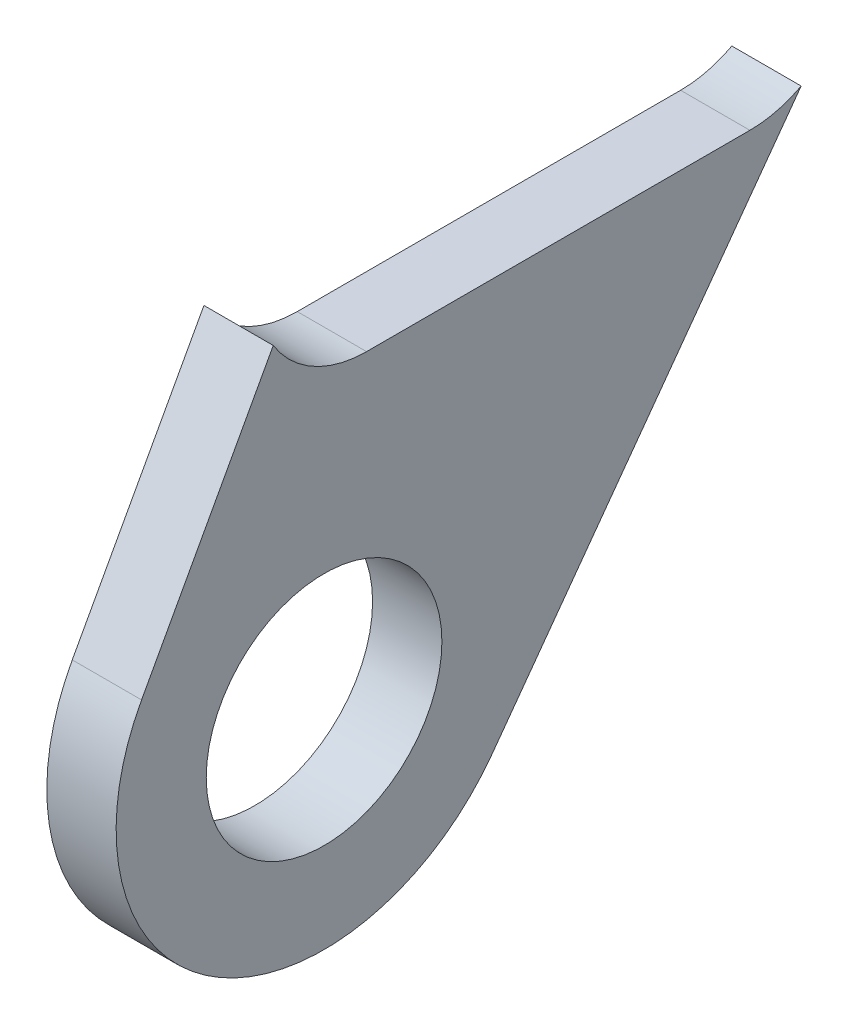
from build123d import *

# Parameters (mm, degrees)
ESQUISSE1_R      = 10.2
EXTRUSION1_DEPTH = 6


with BuildPart() as part:
    # Esquisse1 → Extrusion1 (new body)
    with BuildSketch(Plane(origin=(0, 0, 0), x_dir=(0, 0, -1), z_dir=(1, 0, 0))):
        with BuildLine():
            Line((-15.798088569, 8.626725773), (-4.4, 29.5))
            ThreePointArc((-4.4, 29.5), (-0.945563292, 26.200903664), (3.677747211, 25))
            Line((3.677747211, 25), (36.862658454, 25))
            ThreePointArc((36.862658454, 25), (39.148484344, 25.279099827), (41.3, 26.1))
            Line((41.3, 26.1), (14.54569562, -10.60295897))
            ThreePointArc((14.54569562, -10.60295897), (-9.635212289, -15.204035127), (-15.798088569, 8.626725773))
        make_face()
        Circle(ESQUISSE1_R, mode=Mode.SUBTRACT)
    extrude(amount=EXTRUSION1_DEPTH)


solid = part.part
